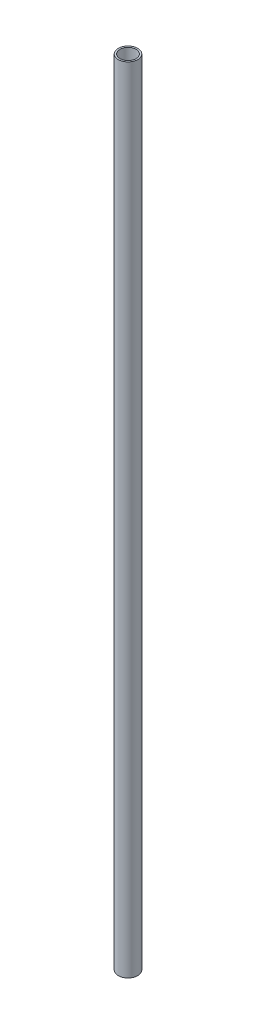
from build123d import *

# Parameters (mm, degrees)
SKETCH1_R           = 9.525
SKETCH1_R_2         = 7.874
EXTRUDE_THIN1_DEPTH = 774.7


with BuildPart() as part:
    # Sketch1 → Extrude-Thin1 (new body)
    with BuildSketch(Plane(origin=(0, 0, 0), x_dir=(1, 0, 0), z_dir=(0, 1, 0))):
        Circle(SKETCH1_R)
        Circle(SKETCH1_R_2, mode=Mode.SUBTRACT)
    extrude(amount=EXTRUDE_THIN1_DEPTH)


solid = part.part
